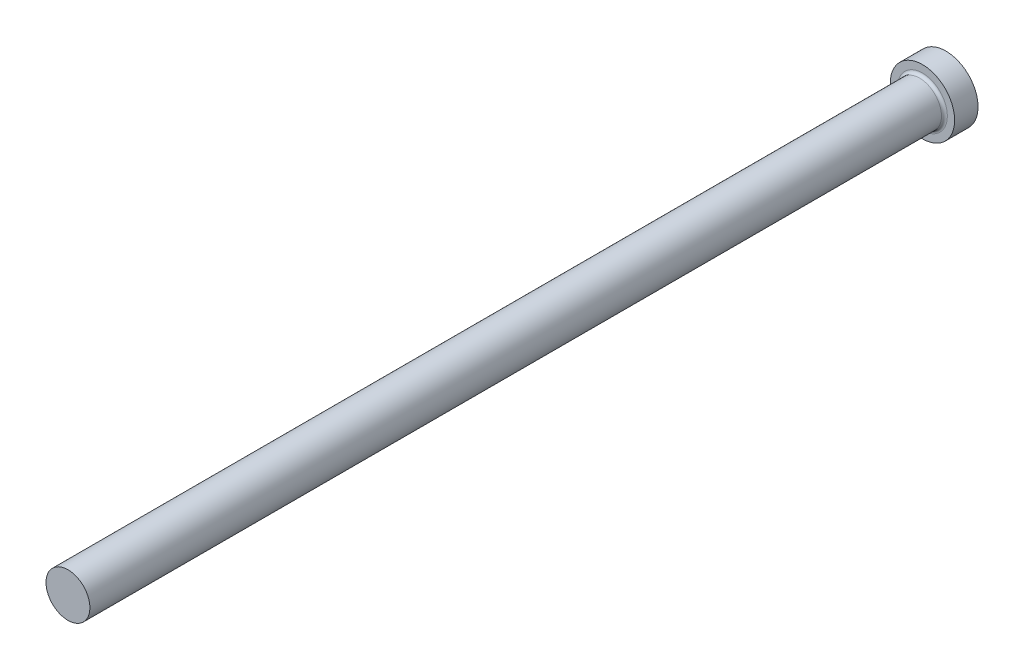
ISO-10303-21;
HEADER;
FILE_DESCRIPTION(('STEP AP214'),'2;1');
FILE_NAME('part.step','',(''),(''),'','','');
FILE_SCHEMA(('AUTOMOTIVE_DESIGN { 1 0 10303 214 1 1 1 1 }'));
ENDSEC;
DATA;
#1=APPLICATION_CONTEXT('core data for automotive mechanical design processes');
#2=APPLICATION_PROTOCOL_DEFINITION('international standard','automotive_design',2000,#1);
#3=PRODUCT_CONTEXT('',#1,'mechanical');
#4=PRODUCT('Part','Part','',(#3));
#5=PRODUCT_RELATED_PRODUCT_CATEGORY('part','',(#4));
#6=PRODUCT_DEFINITION_FORMATION('','',#4);
#7=PRODUCT_DEFINITION_CONTEXT('part definition',#1,'design');
#8=PRODUCT_DEFINITION('design','',#6,#7);
#9=PRODUCT_DEFINITION_SHAPE('','',#8);
#10=(LENGTH_UNIT() NAMED_UNIT(*) SI_UNIT(.MILLI.,.METRE.));
#11=(NAMED_UNIT(*) PLANE_ANGLE_UNIT() SI_UNIT($,.RADIAN.));
#12=(NAMED_UNIT(*) SI_UNIT($,.STERADIAN.) SOLID_ANGLE_UNIT());
#13=UNCERTAINTY_MEASURE_WITH_UNIT(LENGTH_MEASURE(1.E-05),#10,'distance_accuracy_value','');
#14=(GEOMETRIC_REPRESENTATION_CONTEXT(3) GLOBAL_UNCERTAINTY_ASSIGNED_CONTEXT((#13)) GLOBAL_UNIT_ASSIGNED_CONTEXT((#10,
#11,#12)) REPRESENTATION_CONTEXT('',''));
#15=CARTESIAN_POINT('',(0.,0.,0.));
#16=DIRECTION('',(0.,0.,1.));
#17=DIRECTION('',(1.,0.,0.));
#18=AXIS2_PLACEMENT_3D('',#15,#16,#17);
#19=CARTESIAN_POINT('',(5.5,0.,4.));
#20=DIRECTION('',(0.,0.,-1.));
#21=DIRECTION('',(-1.,0.,0.));
#22=AXIS2_PLACEMENT_3D('',#19,#20,#21);
#23=PLANE('',#22);
#24=CARTESIAN_POINT('',(0.,0.,4.));
#25=DIRECTION('',(0.,0.,-1.));
#26=DIRECTION('',(-1.,0.,0.));
#27=AXIS2_PLACEMENT_3D('',#24,#25,#26);
#28=CIRCLE('',#27,4.25000000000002);
#29=CARTESIAN_POINT('',(-4.25000000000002,0.,4.));
#30=VERTEX_POINT('',#29);
#31=EDGE_CURVE('E40',#30,#30,#28,.T.);
#32=ORIENTED_EDGE('',*,*,#31,.T.);
#33=EDGE_LOOP('',(#32));
#34=FACE_BOUND('',#33,.T.);
#35=CARTESIAN_POINT('',(0.,0.,4.));
#36=DIRECTION('',(0.,0.,-1.));
#37=DIRECTION('',(-1.,0.,0.));
#38=AXIS2_PLACEMENT_3D('',#35,#36,#37);
#39=CIRCLE('',#38,5.5);
#40=CARTESIAN_POINT('',(-5.5,0.,4.));
#41=VERTEX_POINT('',#40);
#42=EDGE_CURVE('E44',#41,#41,#39,.T.);
#43=ORIENTED_EDGE('',*,*,#42,.F.);
#44=EDGE_LOOP('',(#43));
#45=FACE_BOUND('',#44,.T.);
#46=ADVANCED_FACE('F33',(#34,#45),#23,.F.);
#47=CARTESIAN_POINT('',(0.,0.,-9.03322817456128));
#48=DIRECTION('',(0.,0.,-1.));
#49=DIRECTION('',(-1.,0.,0.));
#50=AXIS2_PLACEMENT_3D('',#47,#48,#49);
#51=CYLINDRICAL_SURFACE('',#50,5.5);
#52=CARTESIAN_POINT('',(0.,0.,0.));
#53=DIRECTION('',(0.,0.,-1.));
#54=DIRECTION('',(-1.,0.,0.));
#55=AXIS2_PLACEMENT_3D('',#52,#53,#54);
#56=CIRCLE('',#55,5.5);
#57=CARTESIAN_POINT('',(-5.5,0.,0.));
#58=VERTEX_POINT('',#57);
#59=EDGE_CURVE('E48',#58,#58,#56,.T.);
#60=ORIENTED_EDGE('',*,*,#59,.F.);
#61=EDGE_LOOP('',(#60));
#62=FACE_BOUND('',#61,.T.);
#63=ORIENTED_EDGE('',*,*,#42,.T.);
#64=EDGE_LOOP('',(#63));
#65=FACE_BOUND('',#64,.T.);
#66=ADVANCED_FACE('F68',(#62,#65),#51,.T.);
#67=CARTESIAN_POINT('',(0.,0.,0.));
#68=DIRECTION('',(0.,0.,1.));
#69=DIRECTION('',(1.,0.,0.));
#70=AXIS2_PLACEMENT_3D('',#67,#68,#69);
#71=PLANE('',#70);
#72=ORIENTED_EDGE('',*,*,#59,.T.);
#73=EDGE_LOOP('',(#72));
#74=FACE_BOUND('',#73,.T.);
#75=ADVANCED_FACE('F61',(#74),#71,.F.);
#76=CARTESIAN_POINT('',(0.,0.,150.));
#77=DIRECTION('',(0.,0.,-1.));
#78=DIRECTION('',(-1.,0.,0.));
#79=AXIS2_PLACEMENT_3D('',#76,#77,#78);
#80=PLANE('',#79);
#81=CARTESIAN_POINT('',(0.,0.,150.));
#82=DIRECTION('',(0.,0.,-1.));
#83=DIRECTION('',(-1.,0.,0.));
#84=AXIS2_PLACEMENT_3D('',#81,#82,#83);
#85=CIRCLE('',#84,3.75000000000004);
#86=CARTESIAN_POINT('',(-3.75000000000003,0.,150.));
#87=VERTEX_POINT('',#86);
#88=EDGE_CURVE('E53',#87,#87,#85,.T.);
#89=ORIENTED_EDGE('',*,*,#88,.F.);
#90=EDGE_LOOP('',(#89));
#91=FACE_BOUND('',#90,.T.);
#92=ADVANCED_FACE('F59',(#91),#80,.F.);
#93=CARTESIAN_POINT('',(0.,0.,-9.03322817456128));
#94=DIRECTION('',(0.,0.,-1.));
#95=DIRECTION('',(-1.,0.,0.));
#96=AXIS2_PLACEMENT_3D('',#93,#94,#95);
#97=CYLINDRICAL_SURFACE('',#96,3.75000000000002);
#98=CARTESIAN_POINT('',(0.,0.,4.5));
#99=DIRECTION('',(0.,0.,-1.));
#100=DIRECTION('',(-1.,0.,0.));
#101=AXIS2_PLACEMENT_3D('',#98,#99,#100);
#102=CIRCLE('',#101,3.75000000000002);
#103=CARTESIAN_POINT('',(-3.75000000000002,0.,4.5));
#104=VERTEX_POINT('',#103);
#105=EDGE_CURVE('E10',#104,#104,#102,.F.);
#106=ORIENTED_EDGE('',*,*,#105,.T.);
#107=EDGE_LOOP('',(#106));
#108=FACE_BOUND('',#107,.T.);
#109=ORIENTED_EDGE('',*,*,#88,.T.);
#110=EDGE_LOOP('',(#109));
#111=FACE_BOUND('',#110,.T.);
#112=ADVANCED_FACE('F57',(#108,#111),#97,.T.);
#113=CARTESIAN_POINT('',(0.,0.,4.5));
#114=DIRECTION('',(0.,0.,-1.));
#115=DIRECTION('',(-1.,0.,0.));
#116=AXIS2_PLACEMENT_3D('',#113,#114,#115);
#117=TOROIDAL_SURFACE('',#116,4.25000000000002,0.5);
#118=ORIENTED_EDGE('',*,*,#105,.F.);
#119=EDGE_LOOP('',(#118));
#120=FACE_BOUND('',#119,.T.);
#121=ORIENTED_EDGE('',*,*,#31,.F.);
#122=EDGE_LOOP('',(#121));
#123=FACE_BOUND('',#122,.T.);
#124=ADVANCED_FACE('F35',(#120,#123),#117,.F.);
#125=CLOSED_SHELL('',(#46,#66,#75,#92,#112,#124));
#126=MANIFOLD_SOLID_BREP('B2',#125);
#127=ADVANCED_BREP_SHAPE_REPRESENTATION('',(#18,#126),#14);
#128=SHAPE_DEFINITION_REPRESENTATION(#9,#127);
ENDSEC;
END-ISO-10303-21;
